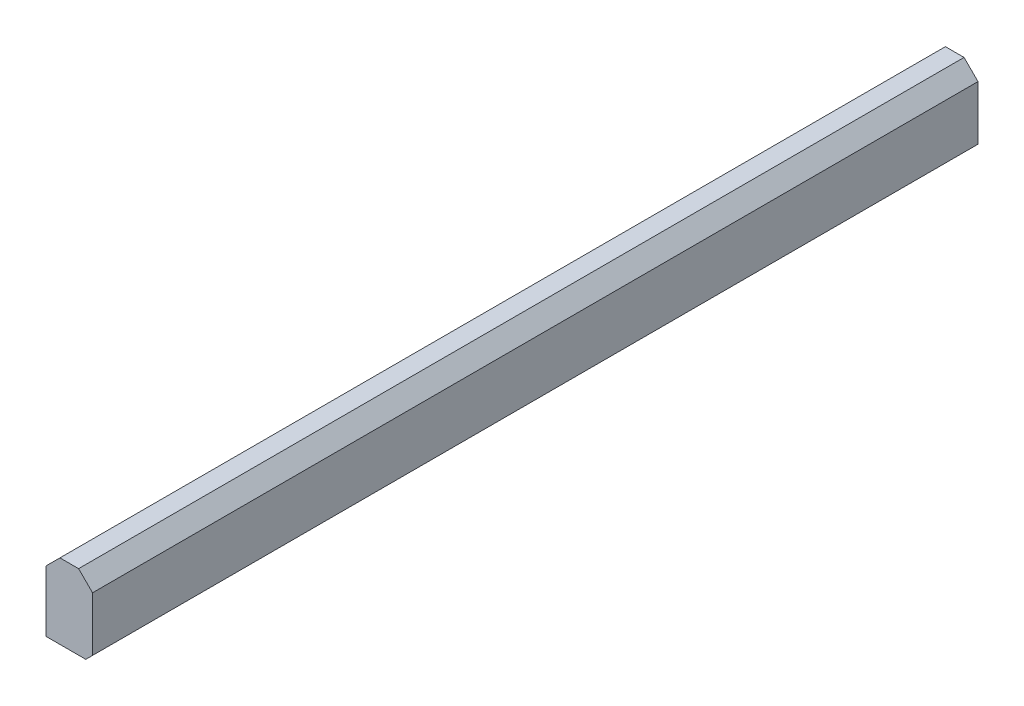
ISO-10303-21;
HEADER;
FILE_DESCRIPTION(('STEP AP214'),'2;1');
FILE_NAME('part.step','',(''),(''),'','','');
FILE_SCHEMA(('AUTOMOTIVE_DESIGN { 1 0 10303 214 1 1 1 1 }'));
ENDSEC;
DATA;
#1=APPLICATION_CONTEXT('core data for automotive mechanical design processes');
#2=APPLICATION_PROTOCOL_DEFINITION('international standard','automotive_design',2000,#1);
#3=PRODUCT_CONTEXT('',#1,'mechanical');
#4=PRODUCT('Part','Part','',(#3));
#5=PRODUCT_RELATED_PRODUCT_CATEGORY('part','',(#4));
#6=PRODUCT_DEFINITION_FORMATION('','',#4);
#7=PRODUCT_DEFINITION_CONTEXT('part definition',#1,'design');
#8=PRODUCT_DEFINITION('design','',#6,#7);
#9=PRODUCT_DEFINITION_SHAPE('','',#8);
#10=(LENGTH_UNIT() NAMED_UNIT(*) SI_UNIT(.MILLI.,.METRE.));
#11=(NAMED_UNIT(*) PLANE_ANGLE_UNIT() SI_UNIT($,.RADIAN.));
#12=(NAMED_UNIT(*) SI_UNIT($,.STERADIAN.) SOLID_ANGLE_UNIT());
#13=UNCERTAINTY_MEASURE_WITH_UNIT(LENGTH_MEASURE(1.E-05),#10,'distance_accuracy_value','');
#14=(GEOMETRIC_REPRESENTATION_CONTEXT(3) GLOBAL_UNCERTAINTY_ASSIGNED_CONTEXT((#13)) GLOBAL_UNIT_ASSIGNED_CONTEXT((#10,
#11,#12)) REPRESENTATION_CONTEXT('',''));
#15=CARTESIAN_POINT('',(0.,0.,0.));
#16=DIRECTION('',(0.,0.,1.));
#17=DIRECTION('',(1.,0.,0.));
#18=AXIS2_PLACEMENT_3D('',#15,#16,#17);
#19=CARTESIAN_POINT('',(-58.42,94.107,1111.357));
#20=DIRECTION('',(0.,-1.,0.));
#21=DIRECTION('',(1.,0.,0.));
#22=AXIS2_PLACEMENT_3D('',#19,#20,#21);
#23=PLANE('',#22);
#24=DIRECTION('',(-1.,0.,0.));
#25=VECTOR('',#24,1.);
#26=CARTESIAN_POINT('',(-58.42,94.107,-1111.357));
#27=LINE('',#26,#25);
#28=CARTESIAN_POINT('',(23.4200000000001,94.107,-1111.357));
#29=VERTEX_POINT('',#28);
#30=CARTESIAN_POINT('',(-23.4200000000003,94.107,-1111.357));
#31=VERTEX_POINT('',#30);
#32=EDGE_CURVE('E141',#29,#31,#27,.T.);
#33=ORIENTED_EDGE('',*,*,#32,.T.);
#34=DIRECTION('',(0.,0.,1.));
#35=VECTOR('',#34,1.);
#36=CARTESIAN_POINT('',(-23.4200000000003,94.107,1111.357));
#37=LINE('',#36,#35);
#38=CARTESIAN_POINT('',(-23.4200000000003,94.107,1111.357));
#39=VERTEX_POINT('',#38);
#40=EDGE_CURVE('E69',#31,#39,#37,.T.);
#41=ORIENTED_EDGE('',*,*,#40,.T.);
#42=DIRECTION('',(-1.,0.,0.));
#43=VECTOR('',#42,1.);
#44=CARTESIAN_POINT('',(-58.42,94.107,1111.357));
#45=LINE('',#44,#43);
#46=CARTESIAN_POINT('',(23.4200000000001,94.107,1111.357));
#47=VERTEX_POINT('',#46);
#48=EDGE_CURVE('E116',#47,#39,#45,.T.);
#49=ORIENTED_EDGE('',*,*,#48,.F.);
#50=DIRECTION('',(0.,0.,-1.));
#51=VECTOR('',#50,1.);
#52=CARTESIAN_POINT('',(23.4200000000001,94.107,1111.357));
#53=LINE('',#52,#51);
#54=EDGE_CURVE('E175',#47,#29,#53,.T.);
#55=ORIENTED_EDGE('',*,*,#54,.T.);
#56=EDGE_LOOP('',(#33,#41,#49,#55));
#57=FACE_BOUND('',#56,.T.);
#58=ADVANCED_FACE('F46',(#57),#23,.F.);
#59=CARTESIAN_POINT('',(-58.42,-94.107,1111.357));
#60=DIRECTION('',(1.,0.,0.));
#61=DIRECTION('',(0.,0.,-1.));
#62=AXIS2_PLACEMENT_3D('',#59,#60,#61);
#63=PLANE('',#62);
#64=DIRECTION('',(0.,-1.,0.));
#65=VECTOR('',#64,1.);
#66=CARTESIAN_POINT('',(-58.42,-94.107,1111.357));
#67=LINE('',#66,#65);
#68=CARTESIAN_POINT('',(-58.42,59.1070000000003,1111.357));
#69=VERTEX_POINT('',#68);
#70=CARTESIAN_POINT('',(-58.42,-94.107,1111.357));
#71=VERTEX_POINT('',#70);
#72=EDGE_CURVE('E108',#69,#71,#67,.T.);
#73=ORIENTED_EDGE('',*,*,#72,.F.);
#74=DIRECTION('',(0.,0.,-1.));
#75=VECTOR('',#74,1.);
#76=CARTESIAN_POINT('',(-58.42,59.1070000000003,1111.357));
#77=LINE('',#76,#75);
#78=CARTESIAN_POINT('',(-58.42,59.1070000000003,-1111.357));
#79=VERTEX_POINT('',#78);
#80=EDGE_CURVE('E164',#69,#79,#77,.T.);
#81=ORIENTED_EDGE('',*,*,#80,.T.);
#82=DIRECTION('',(0.,-1.,0.));
#83=VECTOR('',#82,1.);
#84=CARTESIAN_POINT('',(-58.42,-94.107,-1111.357));
#85=LINE('',#84,#83);
#86=CARTESIAN_POINT('',(-58.42,-94.107,-1111.357));
#87=VERTEX_POINT('',#86);
#88=EDGE_CURVE('E127',#79,#87,#85,.T.);
#89=ORIENTED_EDGE('',*,*,#88,.T.);
#90=DIRECTION('',(0.,0.,-1.));
#91=VECTOR('',#90,1.);
#92=CARTESIAN_POINT('',(-58.42,-94.107,1111.357));
#93=LINE('',#92,#91);
#94=EDGE_CURVE('E121',#71,#87,#93,.T.);
#95=ORIENTED_EDGE('',*,*,#94,.F.);
#96=EDGE_LOOP('',(#73,#81,#89,#95));
#97=FACE_BOUND('',#96,.T.);
#98=ADVANCED_FACE('F124',(#97),#63,.F.);
#99=CARTESIAN_POINT('',(-58.42,-94.107,1111.357));
#100=DIRECTION('',(0.,1.,0.));
#101=DIRECTION('',(-1.,0.,0.));
#102=AXIS2_PLACEMENT_3D('',#99,#100,#101);
#103=PLANE('',#102);
#104=DIRECTION('',(1.,0.,0.));
#105=VECTOR('',#104,1.);
#106=CARTESIAN_POINT('',(-58.42,-94.107,-1111.357));
#107=LINE('',#106,#105);
#108=CARTESIAN_POINT('',(41.4200000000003,-94.107,-1111.357));
#109=VERTEX_POINT('',#108);
#110=EDGE_CURVE('E146',#87,#109,#107,.T.);
#111=ORIENTED_EDGE('',*,*,#110,.T.);
#112=DIRECTION('',(0.,0.,1.));
#113=VECTOR('',#112,1.);
#114=CARTESIAN_POINT('',(41.4200000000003,-94.107,1111.357));
#115=LINE('',#114,#113);
#116=CARTESIAN_POINT('',(41.4200000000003,-94.107,1111.357));
#117=VERTEX_POINT('',#116);
#118=EDGE_CURVE('E138',#109,#117,#115,.T.);
#119=ORIENTED_EDGE('',*,*,#118,.T.);
#120=DIRECTION('',(1.,0.,0.));
#121=VECTOR('',#120,1.);
#122=CARTESIAN_POINT('',(-58.42,-94.107,1111.357));
#123=LINE('',#122,#121);
#124=EDGE_CURVE('E114',#71,#117,#123,.T.);
#125=ORIENTED_EDGE('',*,*,#124,.F.);
#126=ORIENTED_EDGE('',*,*,#94,.T.);
#127=EDGE_LOOP('',(#111,#119,#125,#126));
#128=FACE_BOUND('',#127,.T.);
#129=ADVANCED_FACE('F135',(#128),#103,.F.);
#130=CARTESIAN_POINT('',(58.42,-94.107,1111.357));
#131=DIRECTION('',(-1.,0.,0.));
#132=DIRECTION('',(0.,0.,1.));
#133=AXIS2_PLACEMENT_3D('',#130,#131,#132);
#134=PLANE('',#133);
#135=DIRECTION('',(0.,1.,0.));
#136=VECTOR('',#135,1.);
#137=CARTESIAN_POINT('',(58.42,-94.107,-1111.357));
#138=LINE('',#137,#136);
#139=CARTESIAN_POINT('',(58.42,-77.1070000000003,-1111.357));
#140=VERTEX_POINT('',#139);
#141=CARTESIAN_POINT('',(58.42,59.1070000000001,-1111.357));
#142=VERTEX_POINT('',#141);
#143=EDGE_CURVE('E151',#140,#142,#138,.T.);
#144=ORIENTED_EDGE('',*,*,#143,.T.);
#145=DIRECTION('',(0.,0.,1.));
#146=VECTOR('',#145,1.);
#147=CARTESIAN_POINT('',(58.42,59.1070000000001,1111.357));
#148=LINE('',#147,#146);
#149=CARTESIAN_POINT('',(58.42,59.1070000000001,1111.357));
#150=VERTEX_POINT('',#149);
#151=EDGE_CURVE('E11',#142,#150,#148,.T.);
#152=ORIENTED_EDGE('',*,*,#151,.T.);
#153=DIRECTION('',(0.,1.,0.));
#154=VECTOR('',#153,1.);
#155=CARTESIAN_POINT('',(58.42,-94.107,1111.357));
#156=LINE('',#155,#154);
#157=CARTESIAN_POINT('',(58.42,-77.1070000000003,1111.357));
#158=VERTEX_POINT('',#157);
#159=EDGE_CURVE('E134',#158,#150,#156,.T.);
#160=ORIENTED_EDGE('',*,*,#159,.F.);
#161=DIRECTION('',(0.,0.,-1.));
#162=VECTOR('',#161,1.);
#163=CARTESIAN_POINT('',(58.42,-77.1070000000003,1111.357));
#164=LINE('',#163,#162);
#165=EDGE_CURVE('E133',#158,#140,#164,.T.);
#166=ORIENTED_EDGE('',*,*,#165,.T.);
#167=EDGE_LOOP('',(#144,#152,#160,#166));
#168=FACE_BOUND('',#167,.T.);
#169=ADVANCED_FACE('F193',(#168),#134,.F.);
#170=CARTESIAN_POINT('',(0.,0.,1111.357));
#171=DIRECTION('',(0.,0.,1.));
#172=DIRECTION('',(1.,0.,0.));
#173=AXIS2_PLACEMENT_3D('',#170,#171,#172);
#174=PLANE('',#173);
#175=ORIENTED_EDGE('',*,*,#48,.T.);
#176=DIRECTION('',(0.707106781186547,0.707106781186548,0.));
#177=VECTOR('',#176,1.);
#178=CARTESIAN_POINT('',(-58.7635000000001,58.7635000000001,1111.357));
#179=LINE('',#178,#177);
#180=EDGE_CURVE('E57',#39,#69,#179,.F.);
#181=ORIENTED_EDGE('',*,*,#180,.T.);
#182=ORIENTED_EDGE('',*,*,#72,.T.);
#183=ORIENTED_EDGE('',*,*,#124,.T.);
#184=DIRECTION('',(-0.707106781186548,-0.707106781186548,0.));
#185=VECTOR('',#184,1.);
#186=CARTESIAN_POINT('',(67.7635000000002,-67.7635000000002,1111.357));
#187=LINE('',#186,#185);
#188=EDGE_CURVE('E165',#117,#158,#187,.F.);
#189=ORIENTED_EDGE('',*,*,#188,.T.);
#190=ORIENTED_EDGE('',*,*,#159,.T.);
#191=DIRECTION('',(0.707106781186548,-0.707106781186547,0.));
#192=VECTOR('',#191,1.);
#193=CARTESIAN_POINT('',(58.7635,58.7635000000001,1111.357));
#194=LINE('',#193,#192);
#195=EDGE_CURVE('E177',#150,#47,#194,.F.);
#196=ORIENTED_EDGE('',*,*,#195,.T.);
#197=EDGE_LOOP('',(#175,#181,#182,#183,#189,#190,#196));
#198=FACE_BOUND('',#197,.T.);
#199=ADVANCED_FACE('F112',(#198),#174,.T.);
#200=CARTESIAN_POINT('',(0.,0.,-1111.357));
#201=DIRECTION('',(0.,0.,1.));
#202=DIRECTION('',(1.,0.,0.));
#203=AXIS2_PLACEMENT_3D('',#200,#201,#202);
#204=PLANE('',#203);
#205=ORIENTED_EDGE('',*,*,#88,.F.);
#206=DIRECTION('',(-0.707106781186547,-0.707106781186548,0.));
#207=VECTOR('',#206,1.);
#208=CARTESIAN_POINT('',(-58.42,59.1070000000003,-1111.357));
#209=LINE('',#208,#207);
#210=EDGE_CURVE('E173',#79,#31,#209,.F.);
#211=ORIENTED_EDGE('',*,*,#210,.T.);
#212=ORIENTED_EDGE('',*,*,#32,.F.);
#213=DIRECTION('',(-0.707106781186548,0.707106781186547,0.));
#214=VECTOR('',#213,1.);
#215=CARTESIAN_POINT('',(23.4200000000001,94.107,-1111.357));
#216=LINE('',#215,#214);
#217=EDGE_CURVE('E169',#29,#142,#216,.F.);
#218=ORIENTED_EDGE('',*,*,#217,.T.);
#219=ORIENTED_EDGE('',*,*,#143,.F.);
#220=DIRECTION('',(0.707106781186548,0.707106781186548,0.));
#221=VECTOR('',#220,1.);
#222=CARTESIAN_POINT('',(58.42,-77.1070000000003,-1111.357));
#223=LINE('',#222,#221);
#224=EDGE_CURVE('E160',#140,#109,#223,.F.);
#225=ORIENTED_EDGE('',*,*,#224,.T.);
#226=ORIENTED_EDGE('',*,*,#110,.F.);
#227=EDGE_LOOP('',(#205,#211,#212,#218,#219,#225,#226));
#228=FACE_BOUND('',#227,.T.);
#229=ADVANCED_FACE('F186',(#228),#204,.F.);
#230=CARTESIAN_POINT('',(58.42,-77.1070000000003,1111.357));
#231=DIRECTION('',(-0.707106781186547,0.707106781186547,0.));
#232=DIRECTION('',(0.,0.,-1.));
#233=AXIS2_PLACEMENT_3D('',#230,#231,#232);
#234=PLANE('',#233);
#235=ORIENTED_EDGE('',*,*,#188,.F.);
#236=ORIENTED_EDGE('',*,*,#118,.F.);
#237=ORIENTED_EDGE('',*,*,#224,.F.);
#238=ORIENTED_EDGE('',*,*,#165,.F.);
#239=EDGE_LOOP('',(#235,#236,#237,#238));
#240=FACE_BOUND('',#239,.T.);
#241=ADVANCED_FACE('F194',(#240),#234,.F.);
#242=CARTESIAN_POINT('',(-58.42,59.1070000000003,1111.357));
#243=DIRECTION('',(0.707106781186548,-0.707106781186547,0.));
#244=DIRECTION('',(0.,0.,-1.));
#245=AXIS2_PLACEMENT_3D('',#242,#243,#244);
#246=PLANE('',#245);
#247=ORIENTED_EDGE('',*,*,#180,.F.);
#248=ORIENTED_EDGE('',*,*,#40,.F.);
#249=ORIENTED_EDGE('',*,*,#210,.F.);
#250=ORIENTED_EDGE('',*,*,#80,.F.);
#251=EDGE_LOOP('',(#247,#248,#249,#250));
#252=FACE_BOUND('',#251,.T.);
#253=ADVANCED_FACE('F198',(#252),#246,.F.);
#254=CARTESIAN_POINT('',(23.4200000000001,94.107,1111.357));
#255=DIRECTION('',(-0.707106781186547,-0.707106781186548,0.));
#256=DIRECTION('',(0.,0.,-1.));
#257=AXIS2_PLACEMENT_3D('',#254,#255,#256);
#258=PLANE('',#257);
#259=ORIENTED_EDGE('',*,*,#195,.F.);
#260=ORIENTED_EDGE('',*,*,#151,.F.);
#261=ORIENTED_EDGE('',*,*,#217,.F.);
#262=ORIENTED_EDGE('',*,*,#54,.F.);
#263=EDGE_LOOP('',(#259,#260,#261,#262));
#264=FACE_BOUND('',#263,.T.);
#265=ADVANCED_FACE('F47',(#264),#258,.F.);
#266=CLOSED_SHELL('',(#58,#98,#129,#169,#199,#229,#241,#253,#265));
#267=MANIFOLD_SOLID_BREP('B2',#266);
#268=ADVANCED_BREP_SHAPE_REPRESENTATION('',(#18,#267),#14);
#269=SHAPE_DEFINITION_REPRESENTATION(#9,#268);
ENDSEC;
END-ISO-10303-21;
